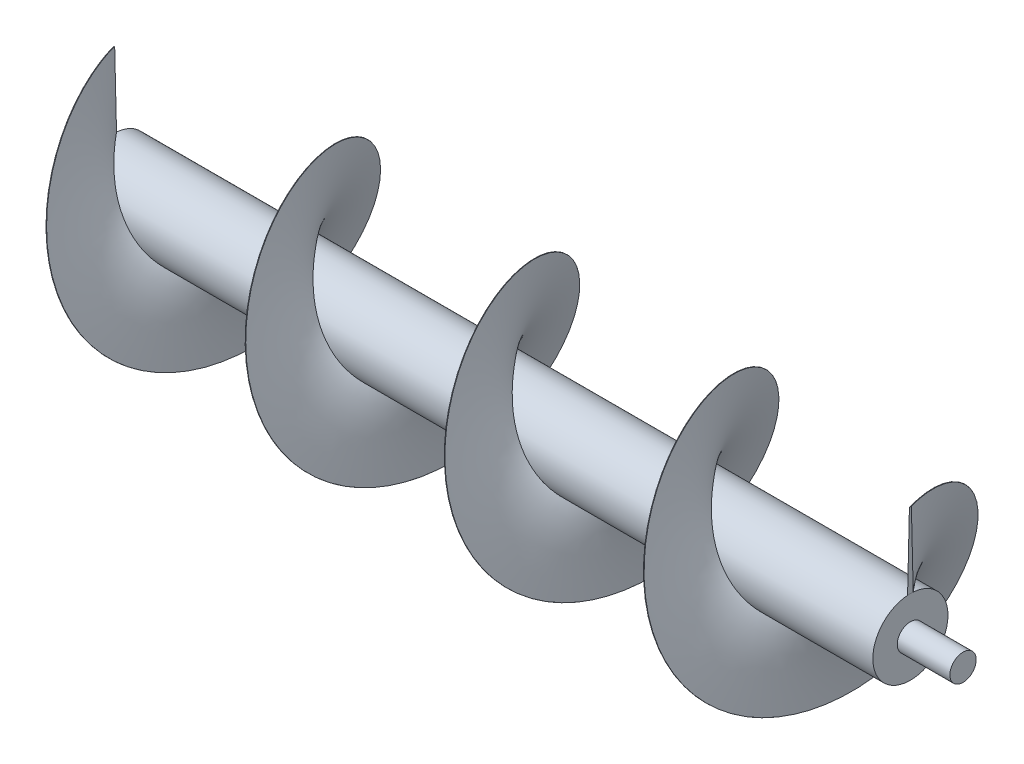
from build123d import *

# Parameters (mm, degrees)
SKETCH1_R           = 17.5
BOSS_EXTRUDE1_DEPTH = 570
BOSS_EXTRUDE2_START = 600
SKETCH1_3_R         = 17.5
BOSS_EXTRUDE2_DEPTH = 600
SKETCH1_4_R         = 50
SKETCH1_4_R_2       = 40
BOSS_EXTRUDE3_DEPTH = 530
BOSS_EXTRUDE4_START = 530
SKETCH1_5_R         = 40
SKETCH1_5_R_2       = 17.5
BOSS_EXTRUDE4_DEPTH = 10
BOSS_EXTRUDE5_START = -520
SKETCH1_6_R         = 40
SKETCH1_6_R_2       = 17.5
BOSS_EXTRUDE5_DEPTH = 10
SWEEP1_PITCH        = 265
SWEEP1_HEIGHT       = 1060
SWEEP1_RADIUS       = 150
SWEEP1_START_ANGLE  = -90


with BuildPart() as part:
    # Sketch1 → Boss-Extrude1 (new body)
    with BuildSketch(Plane(origin=(0, 0, 0), x_dir=(0, 0, -1), z_dir=(1, 0, 0))):
        Circle(SKETCH1_R)
    extrude(amount=-BOSS_EXTRUDE1_DEPTH)

    # Sketch1_3 → Boss-Extrude2 (add)
    with BuildSketch(Plane(origin=(0, 0, 0), x_dir=(0, 0, -1), z_dir=(1, 0, 0)).offset(BOSS_EXTRUDE2_START)):
        Circle(SKETCH1_3_R)
    extrude(amount=-BOSS_EXTRUDE2_DEPTH)



with BuildPart() as body_2:
    # Sketch1_4 → Boss-Extrude3 (new, symmetric)
    with BuildSketch(Plane(origin=(0, 0, 0), x_dir=(0, 0, -1), z_dir=(1, 0, 0))):
        Circle(SKETCH1_4_R)
        Circle(SKETCH1_4_R_2, mode=Mode.SUBTRACT)
    extrude(amount=BOSS_EXTRUDE3_DEPTH, both=True)


with BuildPart() as part_1:
    add(part.part)

    add(body_2.part)  # Boss-Extrude4 merges body 2
    # Sketch1_5 → Boss-Extrude4 (add)
    with BuildSketch(Plane(origin=(0, 0, 0), x_dir=(0, 0, -1), z_dir=(1, 0, 0)).offset(BOSS_EXTRUDE4_START)):
        Circle(SKETCH1_5_R)
        Circle(SKETCH1_5_R_2, mode=Mode.SUBTRACT)
    extrude(amount=-BOSS_EXTRUDE4_DEPTH)

    # Sketch1_6 → Boss-Extrude5 (add)
    with BuildSketch(Plane(origin=(0, 0, 0), x_dir=(0, 0, -1), z_dir=(1, 0, 0)).offset(BOSS_EXTRUDE5_START)):
        Circle(SKETCH1_6_R)
        Circle(SKETCH1_6_R_2, mode=Mode.SUBTRACT)
    extrude(amount=-BOSS_EXTRUDE5_DEPTH)


with BuildPart() as body_2_2:
    # Sweep1: sweep along a helix
    with BuildLine() as sweep1_path:
        add(Helix(SWEEP1_PITCH, SWEEP1_HEIGHT, SWEEP1_RADIUS, center=(530, 0, 0), direction=(-1, 0, 0), mode=Mode.PRIVATE).rotate(Axis((530, 0, 0), (-1, 0, 0)), SWEEP1_START_ANGLE))
    # Sketch3 → Sweep1 (sweep)
    with BuildSketch(Plane(origin=(530, 0, 0), x_dir=(0, 0, -1), z_dir=(1, 0, 0))):
        with BuildLine():
            Line((-1.308980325, 149.99428846), (-3.75, 49.859176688))
            ThreePointArc((-3.75, 49.859176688), (0, 50), (3.75, 49.859176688))
            Line((3.75, 49.859176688), (1.308980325, 149.99428846))
            ThreePointArc((1.308980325, 149.99428846), (0, 150), (-1.308980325, 149.99428846))
        make_face()
    sweep(path=sweep1_path.line, is_frenet=True)


solid = Compound([part_1.part, body_2_2.part])
